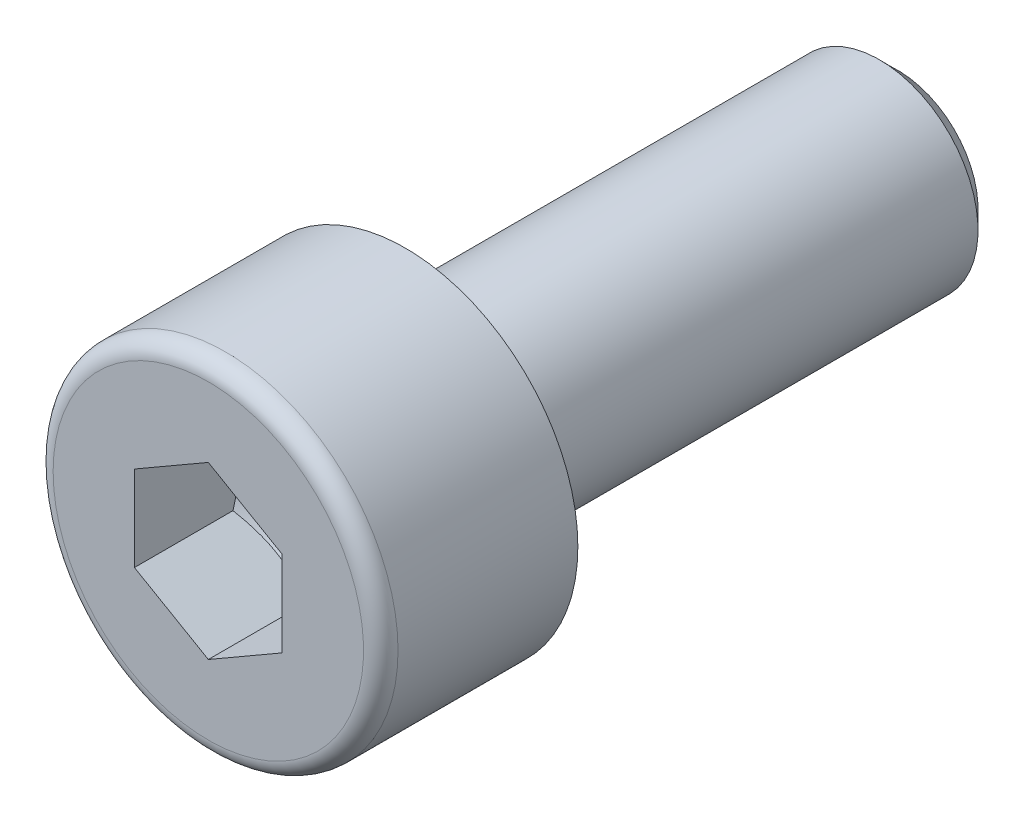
ISO-10303-21;
HEADER;
FILE_DESCRIPTION(('STEP AP214'),'2;1');
FILE_NAME('part.step','',(''),(''),'','','');
FILE_SCHEMA(('AUTOMOTIVE_DESIGN { 1 0 10303 214 1 1 1 1 }'));
ENDSEC;
DATA;
#1=APPLICATION_CONTEXT('core data for automotive mechanical design processes');
#2=APPLICATION_PROTOCOL_DEFINITION('international standard','automotive_design',2000,#1);
#3=PRODUCT_CONTEXT('',#1,'mechanical');
#4=PRODUCT('Part','Part','',(#3));
#5=PRODUCT_RELATED_PRODUCT_CATEGORY('part','',(#4));
#6=PRODUCT_DEFINITION_FORMATION('','',#4);
#7=PRODUCT_DEFINITION_CONTEXT('part definition',#1,'design');
#8=PRODUCT_DEFINITION('design','',#6,#7);
#9=PRODUCT_DEFINITION_SHAPE('','',#8);
#10=(LENGTH_UNIT() NAMED_UNIT(*) SI_UNIT(.MILLI.,.METRE.));
#11=(NAMED_UNIT(*) PLANE_ANGLE_UNIT() SI_UNIT($,.RADIAN.));
#12=(NAMED_UNIT(*) SI_UNIT($,.STERADIAN.) SOLID_ANGLE_UNIT());
#13=UNCERTAINTY_MEASURE_WITH_UNIT(LENGTH_MEASURE(1.E-05),#10,'distance_accuracy_value','');
#14=(GEOMETRIC_REPRESENTATION_CONTEXT(3) GLOBAL_UNCERTAINTY_ASSIGNED_CONTEXT((#13)) GLOBAL_UNIT_ASSIGNED_CONTEXT((#10,
#11,#12)) REPRESENTATION_CONTEXT('',''));
#15=CARTESIAN_POINT('',(0.,0.,0.));
#16=DIRECTION('',(0.,0.,1.));
#17=DIRECTION('',(1.,0.,0.));
#18=AXIS2_PLACEMENT_3D('',#15,#16,#17);
#19=CARTESIAN_POINT('',(-1.75,0.,0.));
#20=DIRECTION('',(0.,0.,-1.));
#21=DIRECTION('',(-1.,0.,0.));
#22=AXIS2_PLACEMENT_3D('',#19,#20,#21);
#23=PLANE('',#22);
#24=CARTESIAN_POINT('',(0.,0.,0.));
#25=DIRECTION('',(0.,0.,-1.));
#26=DIRECTION('',(-1.,0.,0.));
#27=AXIS2_PLACEMENT_3D('',#24,#25,#26);
#28=CIRCLE('',#27,3.5);
#29=CARTESIAN_POINT('',(-3.5,0.,0.));
#30=VERTEX_POINT('',#29);
#31=EDGE_CURVE('E9',#30,#30,#28,.T.);
#32=ORIENTED_EDGE('',*,*,#31,.T.);
#33=EDGE_LOOP('',(#32));
#34=FACE_BOUND('',#33,.T.);
#35=CARTESIAN_POINT('',(0.,0.,0.));
#36=DIRECTION('',(0.,0.,1.));
#37=DIRECTION('',(-1.,0.,0.));
#38=AXIS2_PLACEMENT_3D('',#35,#36,#37);
#39=CIRCLE('',#38,2.);
#40=CARTESIAN_POINT('',(2.,0.,0.));
#41=VERTEX_POINT('',#40);
#42=EDGE_CURVE('E141',#41,#41,#39,.T.);
#43=ORIENTED_EDGE('',*,*,#42,.T.);
#44=EDGE_LOOP('',(#43));
#45=FACE_BOUND('',#44,.T.);
#46=ADVANCED_FACE('F15',(#34,#45),#23,.T.);
#47=CARTESIAN_POINT('',(0.,0.,1.825));
#48=DIRECTION('',(0.,0.,1.));
#49=DIRECTION('',(-1.,0.,0.));
#50=AXIS2_PLACEMENT_3D('',#47,#48,#49);
#51=CYLINDRICAL_SURFACE('',#50,3.5);
#52=CARTESIAN_POINT('',(0.,0.,3.65));
#53=DIRECTION('',(0.,0.,-1.));
#54=DIRECTION('',(-1.,0.,0.));
#55=AXIS2_PLACEMENT_3D('',#52,#53,#54);
#56=CIRCLE('',#55,3.5);
#57=CARTESIAN_POINT('',(-3.5,0.,3.65));
#58=VERTEX_POINT('',#57);
#59=EDGE_CURVE('E24',#58,#58,#56,.T.);
#60=ORIENTED_EDGE('',*,*,#59,.T.);
#61=EDGE_LOOP('',(#60));
#62=FACE_BOUND('',#61,.T.);
#63=ORIENTED_EDGE('',*,*,#31,.F.);
#64=EDGE_LOOP('',(#63));
#65=FACE_BOUND('',#64,.T.);
#66=ADVANCED_FACE('F200',(#62,#65),#51,.T.);
#67=CARTESIAN_POINT('',(0.,0.,3.65));
#68=DIRECTION('',(0.,0.,-1.));
#69=DIRECTION('',(0.,-1.,0.));
#70=AXIS2_PLACEMENT_3D('',#67,#68,#69);
#71=TOROIDAL_SURFACE('',#70,3.15,0.35);
#72=CARTESIAN_POINT('',(0.,0.,4.));
#73=DIRECTION('',(0.,0.,-1.));
#74=DIRECTION('',(-1.,0.,0.));
#75=AXIS2_PLACEMENT_3D('',#72,#73,#74);
#76=CIRCLE('',#75,3.15);
#77=CARTESIAN_POINT('',(-3.15,0.,4.));
#78=VERTEX_POINT('',#77);
#79=EDGE_CURVE('E140',#78,#78,#76,.T.);
#80=ORIENTED_EDGE('',*,*,#79,.T.);
#81=EDGE_LOOP('',(#80));
#82=FACE_BOUND('',#81,.T.);
#83=ORIENTED_EDGE('',*,*,#59,.F.);
#84=EDGE_LOOP('',(#83));
#85=FACE_BOUND('',#84,.T.);
#86=ADVANCED_FACE('F205',(#82,#85),#71,.T.);
#87=CARTESIAN_POINT('',(-1.575,0.,4.));
#88=DIRECTION('',(0.,0.,1.));
#89=DIRECTION('',(1.,0.,0.));
#90=AXIS2_PLACEMENT_3D('',#87,#88,#89);
#91=PLANE('',#90);
#92=ORIENTED_EDGE('',*,*,#79,.F.);
#93=EDGE_LOOP('',(#92));
#94=FACE_BOUND('',#93,.T.);
#95=DIRECTION('',(-0.866025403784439,-0.5,0.));
#96=VECTOR('',#95,1.);
#97=CARTESIAN_POINT('',(0.159374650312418,-1.64003500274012,4.));
#98=LINE('',#97,#96);
#99=CARTESIAN_POINT('',(1.49999930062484,-0.866025,4.));
#100=VERTEX_POINT('',#99);
#101=CARTESIAN_POINT('',(0.,-1.73205,4.));
#102=VERTEX_POINT('',#101);
#103=EDGE_CURVE('E83',#100,#102,#98,.T.);
#104=ORIENTED_EDGE('',*,*,#103,.T.);
#105=DIRECTION('',(-0.866025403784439,0.5,0.));
#106=VECTOR('',#105,1.);
#107=CARTESIAN_POINT('',(-1.34062465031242,-0.958039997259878,4.));
#108=LINE('',#107,#106);
#109=CARTESIAN_POINT('',(-1.49999930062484,-0.866025,4.));
#110=VERTEX_POINT('',#109);
#111=EDGE_CURVE('E79',#102,#110,#108,.T.);
#112=ORIENTED_EDGE('',*,*,#111,.T.);
#113=DIRECTION('',(0.,1.,0.));
#114=VECTOR('',#113,1.);
#115=CARTESIAN_POINT('',(-1.49999930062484,0.,4.));
#116=LINE('',#115,#114);
#117=CARTESIAN_POINT('',(-1.49999930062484,0.866025,4.));
#118=VERTEX_POINT('',#117);
#119=EDGE_CURVE('E145',#110,#118,#116,.T.);
#120=ORIENTED_EDGE('',*,*,#119,.T.);
#121=DIRECTION('',(0.866025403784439,0.5,0.));
#122=VECTOR('',#121,1.);
#123=CARTESIAN_POINT('',(-1.34062465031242,0.958039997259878,4.));
#124=LINE('',#123,#122);
#125=CARTESIAN_POINT('',(0.,1.73205,4.));
#126=VERTEX_POINT('',#125);
#127=EDGE_CURVE('E115',#118,#126,#124,.T.);
#128=ORIENTED_EDGE('',*,*,#127,.T.);
#129=DIRECTION('',(0.866025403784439,-0.5,0.));
#130=VECTOR('',#129,1.);
#131=CARTESIAN_POINT('',(0.159374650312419,1.64003500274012,4.));
#132=LINE('',#131,#130);
#133=CARTESIAN_POINT('',(1.49999930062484,0.866025,4.));
#134=VERTEX_POINT('',#133);
#135=EDGE_CURVE('E116',#126,#134,#132,.T.);
#136=ORIENTED_EDGE('',*,*,#135,.T.);
#137=DIRECTION('',(0.,-1.,0.));
#138=VECTOR('',#137,1.);
#139=CARTESIAN_POINT('',(1.49999930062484,0.,4.));
#140=LINE('',#139,#138);
#141=EDGE_CURVE('E128',#134,#100,#140,.T.);
#142=ORIENTED_EDGE('',*,*,#141,.T.);
#143=EDGE_LOOP('',(#104,#112,#120,#128,#136,#142));
#144=FACE_BOUND('',#143,.T.);
#145=ADVANCED_FACE('F182',(#94,#144),#91,.T.);
#146=CARTESIAN_POINT('',(-0.8105625,0.,-10.));
#147=DIRECTION('',(0.,0.,-1.));
#148=DIRECTION('',(-1.,0.,0.));
#149=AXIS2_PLACEMENT_3D('',#146,#147,#148);
#150=PLANE('',#149);
#151=CARTESIAN_POINT('',(0.,0.,-10.));
#152=DIRECTION('',(0.,0.,-1.));
#153=DIRECTION('',(-1.,0.,0.));
#154=AXIS2_PLACEMENT_3D('',#151,#152,#153);
#155=CIRCLE('',#154,1.621125);
#156=CARTESIAN_POINT('',(-1.621125,0.,-10.));
#157=VERTEX_POINT('',#156);
#158=EDGE_CURVE('E139',#157,#157,#155,.T.);
#159=ORIENTED_EDGE('',*,*,#158,.T.);
#160=EDGE_LOOP('',(#159));
#161=FACE_BOUND('',#160,.T.);
#162=ADVANCED_FACE('F211',(#161),#150,.T.);
#163=CARTESIAN_POINT('',(0.,0.,-9.8105625));
#164=DIRECTION('',(0.,0.,1.));
#165=DIRECTION('',(-1.,0.,0.));
#166=AXIS2_PLACEMENT_3D('',#163,#164,#165);
#167=CONICAL_SURFACE('',#166,1.8105625,0.785398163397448);
#168=CARTESIAN_POINT('',(0.,0.,-9.621125));
#169=DIRECTION('',(0.,0.,-1.));
#170=DIRECTION('',(-1.,0.,0.));
#171=AXIS2_PLACEMENT_3D('',#168,#169,#170);
#172=CIRCLE('',#171,2.);
#173=CARTESIAN_POINT('',(-2.,0.,-9.621125));
#174=VERTEX_POINT('',#173);
#175=EDGE_CURVE('E137',#174,#174,#172,.T.);
#176=ORIENTED_EDGE('',*,*,#175,.T.);
#177=EDGE_LOOP('',(#176));
#178=FACE_BOUND('',#177,.T.);
#179=ORIENTED_EDGE('',*,*,#158,.F.);
#180=EDGE_LOOP('',(#179));
#181=FACE_BOUND('',#180,.T.);
#182=ADVANCED_FACE('F209',(#178,#181),#167,.T.);
#183=CARTESIAN_POINT('',(0.,0.,-4.3105625));
#184=DIRECTION('',(0.,0.,1.));
#185=DIRECTION('',(-1.,0.,0.));
#186=AXIS2_PLACEMENT_3D('',#183,#184,#185);
#187=CYLINDRICAL_SURFACE('',#186,2.);
#188=ORIENTED_EDGE('',*,*,#42,.F.);
#189=EDGE_LOOP('',(#188));
#190=FACE_BOUND('',#189,.T.);
#191=ORIENTED_EDGE('',*,*,#175,.F.);
#192=EDGE_LOOP('',(#191));
#193=FACE_BOUND('',#192,.T.);
#194=ADVANCED_FACE('F17',(#190,#193),#187,.T.);
#195=CARTESIAN_POINT('',(-0.749999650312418,-1.2990375,4.));
#196=DIRECTION('',(-0.5,-0.866025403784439,0.));
#197=DIRECTION('',(-0.866025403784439,0.5,0.));
#198=AXIS2_PLACEMENT_3D('',#195,#196,#197);
#199=PLANE('',#198);
#200=CARTESIAN_POINT('',(0.,-1.73205,2.));
#201=CARTESIAN_POINT('',(-0.749999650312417,-1.2990375,1.75000011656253));
#202=CARTESIAN_POINT('',(-1.49999930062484,-0.866025,2.));
#203=(BOUNDED_CURVE() B_SPLINE_CURVE(2,(#200,#201,#202),.UNSPECIFIED.,.F.,
.F.) B_SPLINE_CURVE_WITH_KNOTS((3,3),(0.,1.75265338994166),
.UNSPECIFIED.) CURVE() GEOMETRIC_REPRESENTATION_ITEM() RATIONAL_B_SPLINE_CURVE((1.,
1.15470053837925,1.)) REPRESENTATION_ITEM(''));
#204=CARTESIAN_POINT('',(0.,-1.73205,2.));
#205=VERTEX_POINT('',#204);
#206=CARTESIAN_POINT('',(-1.49999930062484,-0.866025,2.));
#207=VERTEX_POINT('',#206);
#208=EDGE_CURVE('E77',#205,#207,#203,.T.);
#209=ORIENTED_EDGE('',*,*,#208,.T.);
#210=DIRECTION('',(0.,0.,-1.));
#211=VECTOR('',#210,1.);
#212=CARTESIAN_POINT('',(-1.49999930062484,-0.866025,4.));
#213=LINE('',#212,#211);
#214=EDGE_CURVE('E138',#110,#207,#213,.T.);
#215=ORIENTED_EDGE('',*,*,#214,.F.);
#216=ORIENTED_EDGE('',*,*,#111,.F.);
#217=DIRECTION('',(0.,0.,-1.));
#218=VECTOR('',#217,1.);
#219=CARTESIAN_POINT('',(0.,-1.73205,4.));
#220=LINE('',#219,#218);
#221=EDGE_CURVE('E72',#102,#205,#220,.T.);
#222=ORIENTED_EDGE('',*,*,#221,.T.);
#223=EDGE_LOOP('',(#209,#215,#216,#222));
#224=FACE_BOUND('',#223,.T.);
#225=ADVANCED_FACE('F74',(#224),#199,.F.);
#226=CARTESIAN_POINT('',(-1.49999930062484,0.,4.));
#227=DIRECTION('',(-1.,0.,0.));
#228=DIRECTION('',(0.,1.,0.));
#229=AXIS2_PLACEMENT_3D('',#226,#227,#228);
#230=PLANE('',#229);
#231=CARTESIAN_POINT('',(-1.49999930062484,-0.866025,2.));
#232=CARTESIAN_POINT('',(-1.49999930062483,0.,1.75000011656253));
#233=CARTESIAN_POINT('',(-1.49999930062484,0.866025,2.));
#234=(BOUNDED_CURVE() B_SPLINE_CURVE(2,(#231,#232,#233),.UNSPECIFIED.,.F.,
.F.) B_SPLINE_CURVE_WITH_KNOTS((3,3),(0.,1.75265338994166),
.UNSPECIFIED.) CURVE() GEOMETRIC_REPRESENTATION_ITEM() RATIONAL_B_SPLINE_CURVE((1.,
1.15470053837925,1.)) REPRESENTATION_ITEM(''));
#235=CARTESIAN_POINT('',(-1.49999930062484,0.866025,2.));
#236=VERTEX_POINT('',#235);
#237=EDGE_CURVE('E99',#207,#236,#234,.T.);
#238=ORIENTED_EDGE('',*,*,#237,.T.);
#239=DIRECTION('',(0.,0.,-1.));
#240=VECTOR('',#239,1.);
#241=CARTESIAN_POINT('',(-1.49999930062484,0.866025,4.));
#242=LINE('',#241,#240);
#243=EDGE_CURVE('E135',#118,#236,#242,.T.);
#244=ORIENTED_EDGE('',*,*,#243,.F.);
#245=ORIENTED_EDGE('',*,*,#119,.F.);
#246=ORIENTED_EDGE('',*,*,#214,.T.);
#247=EDGE_LOOP('',(#238,#244,#245,#246));
#248=FACE_BOUND('',#247,.T.);
#249=ADVANCED_FACE('F177',(#248),#230,.F.);
#250=CARTESIAN_POINT('',(-0.749999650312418,1.2990375,4.));
#251=DIRECTION('',(-0.5,0.866025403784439,0.));
#252=DIRECTION('',(0.866025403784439,0.5,0.));
#253=AXIS2_PLACEMENT_3D('',#250,#251,#252);
#254=PLANE('',#253);
#255=CARTESIAN_POINT('',(-1.49999930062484,0.866025,2.));
#256=CARTESIAN_POINT('',(-0.749999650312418,1.2990375,1.75000011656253));
#257=CARTESIAN_POINT('',(0.,1.73205,2.));
#258=(BOUNDED_CURVE() B_SPLINE_CURVE(2,(#255,#256,#257),.UNSPECIFIED.,.F.,
.F.) B_SPLINE_CURVE_WITH_KNOTS((3,3),(0.,1.75265338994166),
.UNSPECIFIED.) CURVE() GEOMETRIC_REPRESENTATION_ITEM() RATIONAL_B_SPLINE_CURVE((1.,
1.15470053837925,1.)) REPRESENTATION_ITEM(''));
#259=CARTESIAN_POINT('',(0.,1.73205,2.));
#260=VERTEX_POINT('',#259);
#261=EDGE_CURVE('E101',#236,#260,#258,.T.);
#262=ORIENTED_EDGE('',*,*,#261,.T.);
#263=DIRECTION('',(0.,0.,-1.));
#264=VECTOR('',#263,1.);
#265=CARTESIAN_POINT('',(0.,1.73205,4.));
#266=LINE('',#265,#264);
#267=EDGE_CURVE('E112',#126,#260,#266,.T.);
#268=ORIENTED_EDGE('',*,*,#267,.F.);
#269=ORIENTED_EDGE('',*,*,#127,.F.);
#270=ORIENTED_EDGE('',*,*,#243,.T.);
#271=EDGE_LOOP('',(#262,#268,#269,#270));
#272=FACE_BOUND('',#271,.T.);
#273=ADVANCED_FACE('F226',(#272),#254,.F.);
#274=CARTESIAN_POINT('',(0.749999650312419,1.2990375,4.));
#275=DIRECTION('',(0.5,0.866025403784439,0.));
#276=DIRECTION('',(0.866025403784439,-0.5,0.));
#277=AXIS2_PLACEMENT_3D('',#274,#275,#276);
#278=PLANE('',#277);
#279=CARTESIAN_POINT('',(0.,1.73205,2.));
#280=CARTESIAN_POINT('',(0.749999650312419,1.2990375,1.75000011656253));
#281=CARTESIAN_POINT('',(1.49999930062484,0.866025,2.));
#282=(BOUNDED_CURVE() B_SPLINE_CURVE(2,(#279,#280,#281),.UNSPECIFIED.,.F.,
.F.) B_SPLINE_CURVE_WITH_KNOTS((3,3),(0.,1.75265338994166),
.UNSPECIFIED.) CURVE() GEOMETRIC_REPRESENTATION_ITEM() RATIONAL_B_SPLINE_CURVE((1.,
1.15470053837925,1.)) REPRESENTATION_ITEM(''));
#283=CARTESIAN_POINT('',(1.49999930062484,0.866025,2.));
#284=VERTEX_POINT('',#283);
#285=EDGE_CURVE('E84',#260,#284,#282,.T.);
#286=ORIENTED_EDGE('',*,*,#285,.T.);
#287=DIRECTION('',(0.,0.,-1.));
#288=VECTOR('',#287,1.);
#289=CARTESIAN_POINT('',(1.49999930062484,0.866025,4.));
#290=LINE('',#289,#288);
#291=EDGE_CURVE('E107',#134,#284,#290,.T.);
#292=ORIENTED_EDGE('',*,*,#291,.F.);
#293=ORIENTED_EDGE('',*,*,#135,.F.);
#294=ORIENTED_EDGE('',*,*,#267,.T.);
#295=EDGE_LOOP('',(#286,#292,#293,#294));
#296=FACE_BOUND('',#295,.T.);
#297=ADVANCED_FACE('F231',(#296),#278,.F.);
#298=CARTESIAN_POINT('',(1.49999930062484,0.,4.));
#299=DIRECTION('',(1.,0.,0.));
#300=DIRECTION('',(0.,-1.,0.));
#301=AXIS2_PLACEMENT_3D('',#298,#299,#300);
#302=PLANE('',#301);
#303=CARTESIAN_POINT('',(1.49999930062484,0.866025,2.));
#304=CARTESIAN_POINT('',(1.49999930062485,0.,1.75000011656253));
#305=CARTESIAN_POINT('',(1.49999930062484,-0.866025,2.));
#306=(BOUNDED_CURVE() B_SPLINE_CURVE(2,(#303,#304,#305),.UNSPECIFIED.,.F.,
.F.) B_SPLINE_CURVE_WITH_KNOTS((3,3),(0.,1.75265338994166),
.UNSPECIFIED.) CURVE() GEOMETRIC_REPRESENTATION_ITEM() RATIONAL_B_SPLINE_CURVE((1.,
1.15470053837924,1.)) REPRESENTATION_ITEM(''));
#307=CARTESIAN_POINT('',(1.49999930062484,-0.866025,2.));
#308=VERTEX_POINT('',#307);
#309=EDGE_CURVE('E94',#284,#308,#306,.T.);
#310=ORIENTED_EDGE('',*,*,#309,.T.);
#311=DIRECTION('',(0.,0.,-1.));
#312=VECTOR('',#311,1.);
#313=CARTESIAN_POINT('',(1.49999930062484,-0.866025,4.));
#314=LINE('',#313,#312);
#315=EDGE_CURVE('E90',#100,#308,#314,.T.);
#316=ORIENTED_EDGE('',*,*,#315,.F.);
#317=ORIENTED_EDGE('',*,*,#141,.F.);
#318=ORIENTED_EDGE('',*,*,#291,.T.);
#319=EDGE_LOOP('',(#310,#316,#317,#318));
#320=FACE_BOUND('',#319,.T.);
#321=ADVANCED_FACE('F196',(#320),#302,.F.);
#322=CARTESIAN_POINT('',(0.749999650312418,-1.2990375,4.));
#323=DIRECTION('',(0.5,-0.866025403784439,0.));
#324=DIRECTION('',(-0.866025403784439,-0.5,0.));
#325=AXIS2_PLACEMENT_3D('',#322,#323,#324);
#326=PLANE('',#325);
#327=CARTESIAN_POINT('',(1.49999930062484,-0.866025,2.));
#328=CARTESIAN_POINT('',(0.749999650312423,-1.2990375,1.75000011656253));
#329=CARTESIAN_POINT('',(0.,-1.73205,2.));
#330=(BOUNDED_CURVE() B_SPLINE_CURVE(2,(#327,#328,#329),.UNSPECIFIED.,.F.,
.F.) B_SPLINE_CURVE_WITH_KNOTS((3,3),(0.,1.75265338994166),
.UNSPECIFIED.) CURVE() GEOMETRIC_REPRESENTATION_ITEM() RATIONAL_B_SPLINE_CURVE((1.,
1.15470053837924,1.)) REPRESENTATION_ITEM(''));
#331=EDGE_CURVE('E87',#308,#205,#330,.T.);
#332=ORIENTED_EDGE('',*,*,#331,.T.);
#333=ORIENTED_EDGE('',*,*,#221,.F.);
#334=ORIENTED_EDGE('',*,*,#103,.F.);
#335=ORIENTED_EDGE('',*,*,#315,.T.);
#336=EDGE_LOOP('',(#332,#333,#334,#335));
#337=FACE_BOUND('',#336,.T.);
#338=ADVANCED_FACE('F88',(#337),#326,.F.);
#339=CARTESIAN_POINT('',(0.,0.,1.50000023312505));
#340=DIRECTION('',(0.,0.,1.));
#341=DIRECTION('',(-1.,0.,0.));
#342=AXIS2_PLACEMENT_3D('',#339,#340,#341);
#343=CONICAL_SURFACE('',#342,0.866025,1.0471975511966);
#344=CARTESIAN_POINT('',(0.,0.,1.00000046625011));
#345=VERTEX_POINT('',#344);
#346=VERTEX_LOOP('',#345);
#347=FACE_BOUND('',#346,.T.);
#348=ORIENTED_EDGE('',*,*,#261,.F.);
#349=ORIENTED_EDGE('',*,*,#237,.F.);
#350=ORIENTED_EDGE('',*,*,#208,.F.);
#351=ORIENTED_EDGE('',*,*,#331,.F.);
#352=ORIENTED_EDGE('',*,*,#309,.F.);
#353=ORIENTED_EDGE('',*,*,#285,.F.);
#354=EDGE_LOOP('',(#348,#349,#350,#351,#352,#353));
#355=FACE_BOUND('',#354,.T.);
#356=ADVANCED_FACE('F97',(#347,#355),#343,.F.);
#357=CLOSED_SHELL('',(#46,#66,#86,#145,#162,#182,#194,#225,#249,#273,#297,#321,#338,#356));
#358=MANIFOLD_SOLID_BREP('B1',#357);
#359=ADVANCED_BREP_SHAPE_REPRESENTATION('',(#18,#358),#14);
#360=SHAPE_DEFINITION_REPRESENTATION(#9,#359);
ENDSEC;
END-ISO-10303-21;
